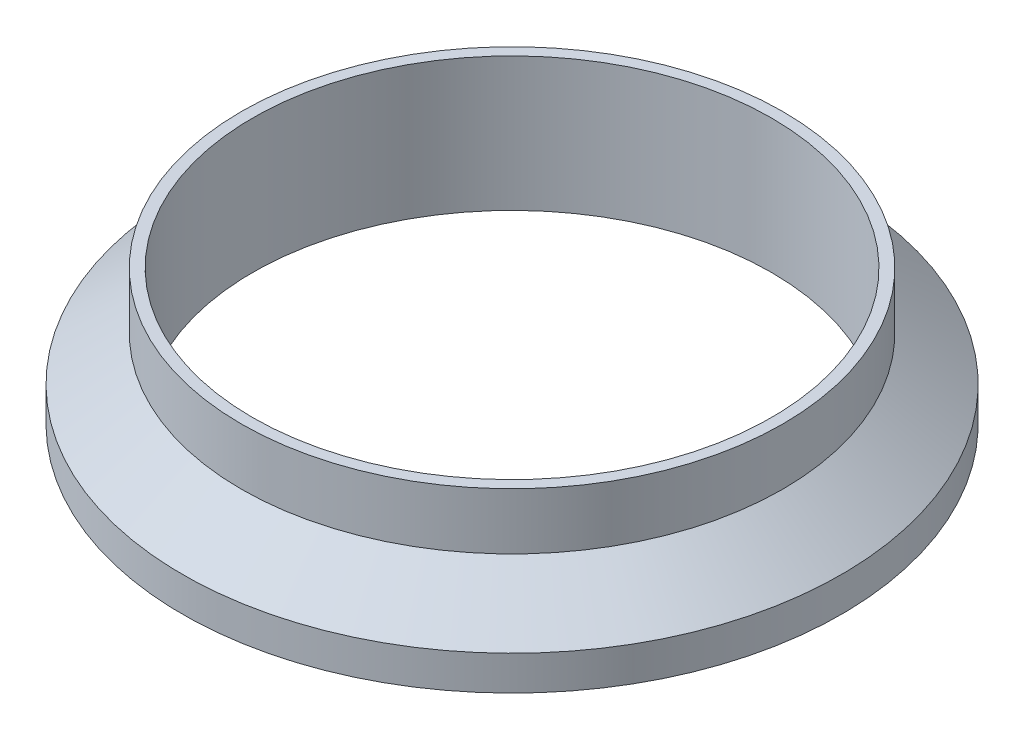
from build123d import *


with BuildPart() as part:
    # Sketch1 → Revolve1 (revolve)
    with BuildSketch(Plane.XY, mode=Mode.PRIVATE) as revolve1_sk:
        with BuildLine():
            Line((-48.6918, 0.288822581), (-48.6918, 25.4))
            Line((-48.6918, 25.4), (-50.8, 25.4))
            Line((-50.8, 25.4), (-50.8, 14.8030187))
            Line((-50.8, 14.8030187), (-61.849, 6.477))
            Line((-61.849, 6.477), (-61.849, 0))
            Line((-61.849, 0), (-58.241259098, 0))
            ThreePointArc((-58.241259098, 0), (-55.646091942, 2.383689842), (-52.812648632, 0.288822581))
            Line((-52.812648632, 0.288822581), (-48.6918, 0.288822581))
        make_face()
    revolve(revolve1_sk.sketch.rotate(Axis((0, 0, 0), (0, 1, 0)), 270), axis=Axis((0, 0, 0), (0, 1, 0)))


solid = part.part
